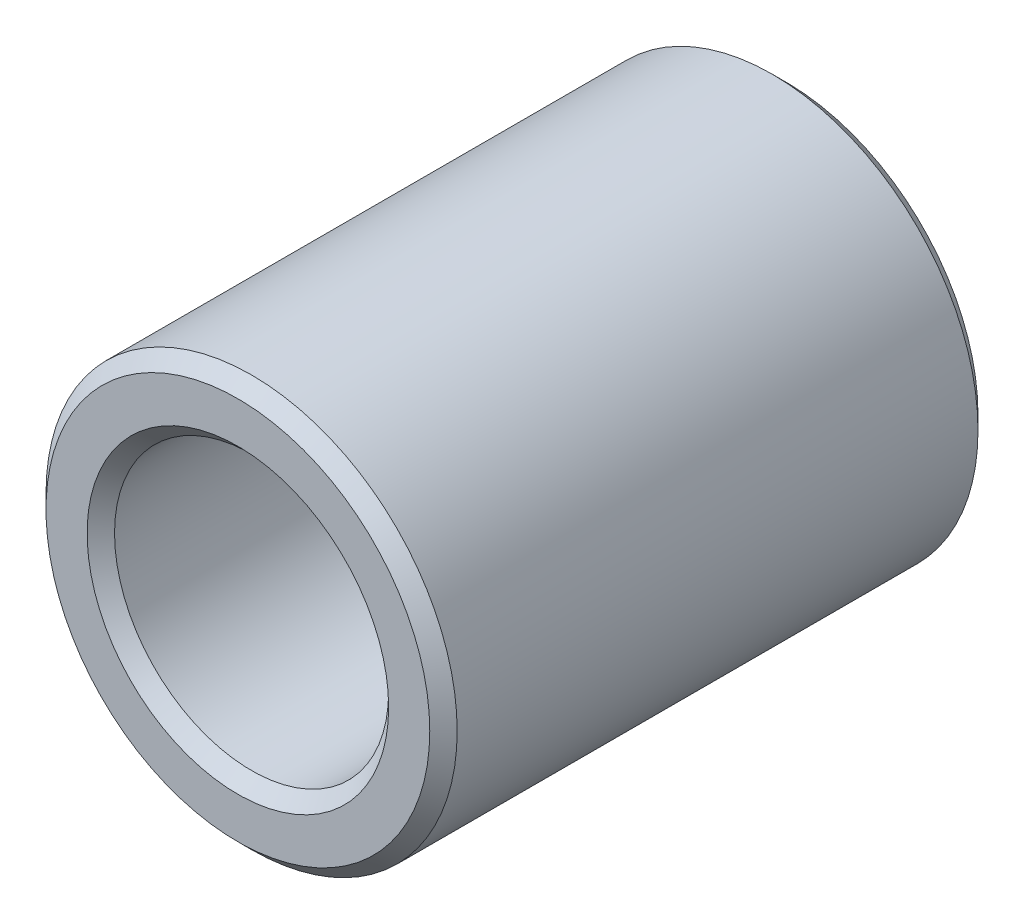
from build123d import *

# Parameters (mm, degrees)
SKETCH1_R           = 60
SKETCH1_R_2         = 40
BOSS_EXTRUDE1_DEPTH = 80
CHAMFER1_SIZE       = 4


with BuildPart() as part:
    # Sketch1 → Boss-Extrude1 (new, symmetric)
    with BuildSketch(Plane.XY):
        Circle(SKETCH1_R)
        Circle(SKETCH1_R_2, mode=Mode.SUBTRACT)
    extrude(amount=BOSS_EXTRUDE1_DEPTH, both=True)

    # Chamfer1
    chamfer1_edges = [part.edges().sort_by_distance(p)[0] for p in [
        (-60, 0, -80),
        (-60, 0, 80),
        (-40, 0, -80),
        (-40, 0, 80),
    ]]
    chamfer(chamfer1_edges, length=CHAMFER1_SIZE)


solid = part.part
